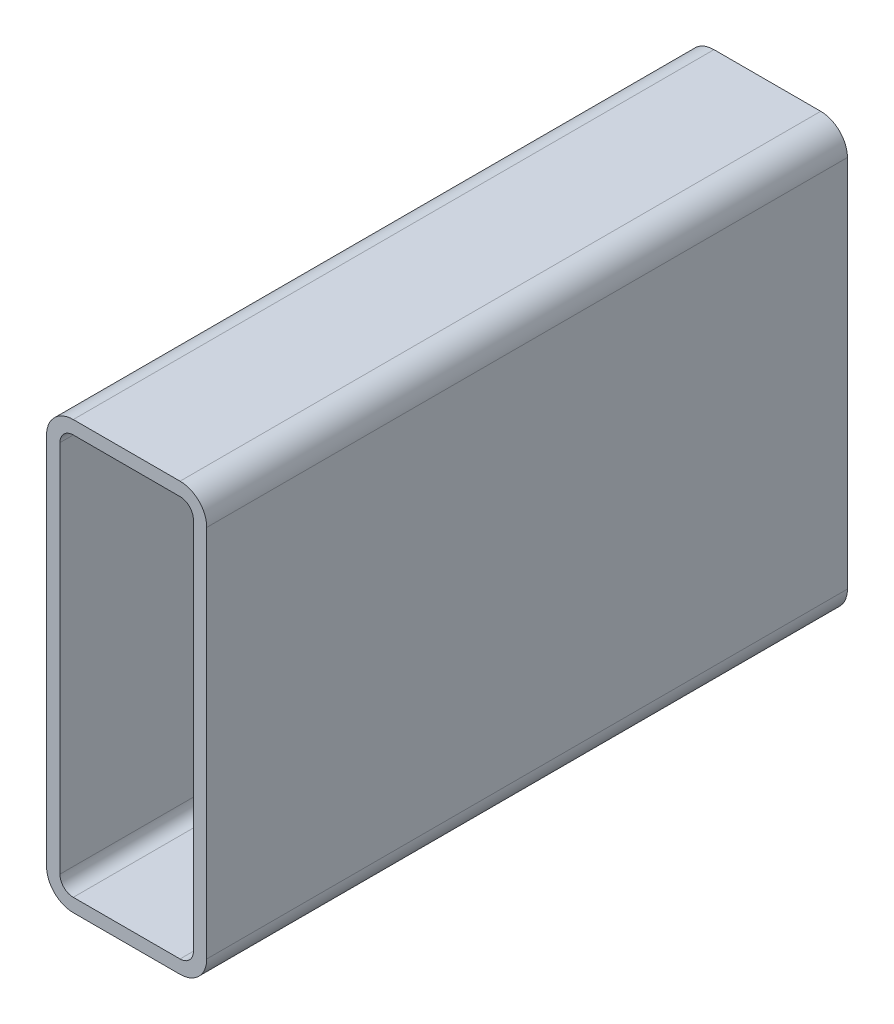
ISO-10303-21;
HEADER;
FILE_DESCRIPTION(('STEP AP214'),'2;1');
FILE_NAME('part.step','',(''),(''),'','','');
FILE_SCHEMA(('AUTOMOTIVE_DESIGN { 1 0 10303 214 1 1 1 1 }'));
ENDSEC;
DATA;
#1=APPLICATION_CONTEXT('core data for automotive mechanical design processes');
#2=APPLICATION_PROTOCOL_DEFINITION('international standard','automotive_design',2000,#1);
#3=PRODUCT_CONTEXT('',#1,'mechanical');
#4=PRODUCT('Part','Part','',(#3));
#5=PRODUCT_RELATED_PRODUCT_CATEGORY('part','',(#4));
#6=PRODUCT_DEFINITION_FORMATION('','',#4);
#7=PRODUCT_DEFINITION_CONTEXT('part definition',#1,'design');
#8=PRODUCT_DEFINITION('design','',#6,#7);
#9=PRODUCT_DEFINITION_SHAPE('','',#8);
#10=(LENGTH_UNIT() NAMED_UNIT(*) SI_UNIT(.MILLI.,.METRE.));
#11=(NAMED_UNIT(*) PLANE_ANGLE_UNIT() SI_UNIT($,.RADIAN.));
#12=(NAMED_UNIT(*) SI_UNIT($,.STERADIAN.) SOLID_ANGLE_UNIT());
#13=UNCERTAINTY_MEASURE_WITH_UNIT(LENGTH_MEASURE(1.E-05),#10,'distance_accuracy_value','');
#14=(GEOMETRIC_REPRESENTATION_CONTEXT(3) GLOBAL_UNCERTAINTY_ASSIGNED_CONTEXT((#13)) GLOBAL_UNIT_ASSIGNED_CONTEXT((#10,
#11,#12)) REPRESENTATION_CONTEXT('',''));
#15=CARTESIAN_POINT('',(0.,0.,0.));
#16=DIRECTION('',(0.,0.,1.));
#17=DIRECTION('',(1.,0.,0.));
#18=AXIS2_PLACEMENT_3D('',#15,#16,#17);
#19=CARTESIAN_POINT('',(15.1891160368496,192.466130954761,304.8));
#20=DIRECTION('',(0.,0.,1.));
#21=DIRECTION('',(1.,0.,0.));
#22=AXIS2_PLACEMENT_3D('',#19,#20,#21);
#23=PLANE('',#22);
#24=CARTESIAN_POINT('',(15.1891160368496,192.466130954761,304.8));
#25=DIRECTION('',(0.,0.,1.));
#26=DIRECTION('',(1.,0.,0.));
#27=AXIS2_PLACEMENT_3D('',#24,#25,#26);
#28=CIRCLE('',#27,12.7);
#29=CARTESIAN_POINT('',(15.1891160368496,205.166130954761,304.8));
#30=VERTEX_POINT('',#29);
#31=CARTESIAN_POINT('',(2.48911603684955,192.466130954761,304.8));
#32=VERTEX_POINT('',#31);
#33=EDGE_CURVE('E211',#30,#32,#28,.T.);
#34=ORIENTED_EDGE('',*,*,#33,.T.);
#35=DIRECTION('',(0.,-1.,0.));
#36=VECTOR('',#35,1.);
#37=CARTESIAN_POINT('',(2.48911603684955,14.6661309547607,304.8));
#38=LINE('',#37,#36);
#39=CARTESIAN_POINT('',(2.48911603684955,14.6661309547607,304.8));
#40=VERTEX_POINT('',#39);
#41=EDGE_CURVE('E214',#32,#40,#38,.T.);
#42=ORIENTED_EDGE('',*,*,#41,.T.);
#43=CARTESIAN_POINT('',(15.1891160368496,14.6661309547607,304.8));
#44=DIRECTION('',(0.,0.,1.));
#45=DIRECTION('',(1.,0.,0.));
#46=AXIS2_PLACEMENT_3D('',#43,#44,#45);
#47=CIRCLE('',#46,12.7);
#48=CARTESIAN_POINT('',(15.1891160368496,1.96613095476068,304.8));
#49=VERTEX_POINT('',#48);
#50=EDGE_CURVE('E217',#40,#49,#47,.T.);
#51=ORIENTED_EDGE('',*,*,#50,.T.);
#52=DIRECTION('',(1.,0.,0.));
#53=VECTOR('',#52,1.);
#54=CARTESIAN_POINT('',(65.9891160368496,1.96613095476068,304.8));
#55=LINE('',#54,#53);
#56=CARTESIAN_POINT('',(65.9891160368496,1.96613095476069,304.8));
#57=VERTEX_POINT('',#56);
#58=EDGE_CURVE('E219',#49,#57,#55,.T.);
#59=ORIENTED_EDGE('',*,*,#58,.T.);
#60=CARTESIAN_POINT('',(65.9891160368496,14.6661309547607,304.8));
#61=DIRECTION('',(0.,0.,1.));
#62=DIRECTION('',(1.,0.,0.));
#63=AXIS2_PLACEMENT_3D('',#60,#61,#62);
#64=CIRCLE('',#63,12.7);
#65=CARTESIAN_POINT('',(78.6891160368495,14.6661309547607,304.8));
#66=VERTEX_POINT('',#65);
#67=EDGE_CURVE('E221',#57,#66,#64,.T.);
#68=ORIENTED_EDGE('',*,*,#67,.T.);
#69=DIRECTION('',(0.,1.,0.));
#70=VECTOR('',#69,1.);
#71=CARTESIAN_POINT('',(78.6891160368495,192.466130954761,304.8));
#72=LINE('',#71,#70);
#73=CARTESIAN_POINT('',(78.6891160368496,192.466130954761,304.8));
#74=VERTEX_POINT('',#73);
#75=EDGE_CURVE('E223',#66,#74,#72,.T.);
#76=ORIENTED_EDGE('',*,*,#75,.T.);
#77=CARTESIAN_POINT('',(65.9891160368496,192.466130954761,304.8));
#78=DIRECTION('',(0.,0.,1.));
#79=DIRECTION('',(1.,0.,0.));
#80=AXIS2_PLACEMENT_3D('',#77,#78,#79);
#81=CIRCLE('',#80,12.7);
#82=CARTESIAN_POINT('',(65.9891160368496,205.166130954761,304.8));
#83=VERTEX_POINT('',#82);
#84=EDGE_CURVE('E225',#74,#83,#81,.T.);
#85=ORIENTED_EDGE('',*,*,#84,.T.);
#86=DIRECTION('',(-1.,0.,0.));
#87=VECTOR('',#86,1.);
#88=CARTESIAN_POINT('',(15.1891160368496,205.166130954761,304.8));
#89=LINE('',#88,#87);
#90=EDGE_CURVE('E227',#83,#30,#89,.T.);
#91=ORIENTED_EDGE('',*,*,#90,.T.);
#92=EDGE_LOOP('',(#34,#42,#51,#59,#68,#76,#85,#91));
#93=FACE_BOUND('',#92,.T.);
#94=DIRECTION('',(0.,-1.,0.));
#95=VECTOR('',#94,1.);
#96=CARTESIAN_POINT('',(8.83911603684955,14.6661309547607,304.8));
#97=LINE('',#96,#95);
#98=CARTESIAN_POINT('',(8.83911603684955,192.466130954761,304.8));
#99=VERTEX_POINT('',#98);
#100=CARTESIAN_POINT('',(8.83911603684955,14.6661309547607,304.8));
#101=VERTEX_POINT('',#100);
#102=EDGE_CURVE('E154',#99,#101,#97,.T.);
#103=ORIENTED_EDGE('',*,*,#102,.F.);
#104=CARTESIAN_POINT('',(15.1891160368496,192.466130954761,304.8));
#105=DIRECTION('',(0.,0.,1.));
#106=DIRECTION('',(1.,0.,0.));
#107=AXIS2_PLACEMENT_3D('',#104,#105,#106);
#108=CIRCLE('',#107,6.35000000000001);
#109=CARTESIAN_POINT('',(15.1891160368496,198.816130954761,304.8));
#110=VERTEX_POINT('',#109);
#111=EDGE_CURVE('E146',#110,#99,#108,.T.);
#112=ORIENTED_EDGE('',*,*,#111,.F.);
#113=DIRECTION('',(-1.,0.,0.));
#114=VECTOR('',#113,1.);
#115=CARTESIAN_POINT('',(15.1891160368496,198.816130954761,304.8));
#116=LINE('',#115,#114);
#117=CARTESIAN_POINT('',(65.9891160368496,198.816130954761,304.8));
#118=VERTEX_POINT('',#117);
#119=EDGE_CURVE('E179',#118,#110,#116,.T.);
#120=ORIENTED_EDGE('',*,*,#119,.F.);
#121=CARTESIAN_POINT('',(65.9891160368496,192.466130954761,304.8));
#122=DIRECTION('',(0.,0.,1.));
#123=DIRECTION('',(1.,0.,0.));
#124=AXIS2_PLACEMENT_3D('',#121,#122,#123);
#125=CIRCLE('',#124,6.35000000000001);
#126=CARTESIAN_POINT('',(72.3391160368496,192.466130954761,304.8));
#127=VERTEX_POINT('',#126);
#128=EDGE_CURVE('E177',#127,#118,#125,.T.);
#129=ORIENTED_EDGE('',*,*,#128,.F.);
#130=DIRECTION('',(0.,1.,0.));
#131=VECTOR('',#130,1.);
#132=CARTESIAN_POINT('',(72.3391160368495,192.466130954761,304.8));
#133=LINE('',#132,#131);
#134=CARTESIAN_POINT('',(72.3391160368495,14.6661309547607,304.8));
#135=VERTEX_POINT('',#134);
#136=EDGE_CURVE('E175',#135,#127,#133,.T.);
#137=ORIENTED_EDGE('',*,*,#136,.F.);
#138=CARTESIAN_POINT('',(65.9891160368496,14.6661309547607,304.8));
#139=DIRECTION('',(0.,0.,1.));
#140=DIRECTION('',(1.,0.,0.));
#141=AXIS2_PLACEMENT_3D('',#138,#139,#140);
#142=CIRCLE('',#141,6.35);
#143=CARTESIAN_POINT('',(65.9891160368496,8.31613095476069,304.8));
#144=VERTEX_POINT('',#143);
#145=EDGE_CURVE('E173',#144,#135,#142,.T.);
#146=ORIENTED_EDGE('',*,*,#145,.F.);
#147=DIRECTION('',(1.,0.,0.));
#148=VECTOR('',#147,1.);
#149=CARTESIAN_POINT('',(65.9891160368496,8.31613095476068,304.8));
#150=LINE('',#149,#148);
#151=CARTESIAN_POINT('',(15.1891160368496,8.31613095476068,304.8));
#152=VERTEX_POINT('',#151);
#153=EDGE_CURVE('E169',#152,#144,#150,.T.);
#154=ORIENTED_EDGE('',*,*,#153,.F.);
#155=CARTESIAN_POINT('',(15.1891160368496,14.6661309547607,304.8));
#156=DIRECTION('',(0.,0.,1.));
#157=DIRECTION('',(1.,0.,0.));
#158=AXIS2_PLACEMENT_3D('',#155,#156,#157);
#159=CIRCLE('',#158,6.35);
#160=EDGE_CURVE('E167',#101,#152,#159,.T.);
#161=ORIENTED_EDGE('',*,*,#160,.F.);
#162=EDGE_LOOP('',(#103,#112,#120,#129,#137,#146,#154,#161));
#163=FACE_BOUND('',#162,.T.);
#164=ADVANCED_FACE('F33',(#93,#163),#23,.T.);
#165=CARTESIAN_POINT('',(15.1891160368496,192.466130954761,0.));
#166=DIRECTION('',(0.,0.,1.));
#167=DIRECTION('',(1.,0.,0.));
#168=AXIS2_PLACEMENT_3D('',#165,#166,#167);
#169=PLANE('',#168);
#170=CARTESIAN_POINT('',(15.1891160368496,192.466130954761,0.));
#171=DIRECTION('',(0.,0.,1.));
#172=DIRECTION('',(1.,0.,0.));
#173=AXIS2_PLACEMENT_3D('',#170,#171,#172);
#174=CIRCLE('',#173,12.7);
#175=CARTESIAN_POINT('',(15.1891160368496,205.166130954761,0.));
#176=VERTEX_POINT('',#175);
#177=CARTESIAN_POINT('',(2.48911603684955,192.466130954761,0.));
#178=VERTEX_POINT('',#177);
#179=EDGE_CURVE('E162',#176,#178,#174,.T.);
#180=ORIENTED_EDGE('',*,*,#179,.F.);
#181=DIRECTION('',(-1.,0.,0.));
#182=VECTOR('',#181,1.);
#183=CARTESIAN_POINT('',(15.1891160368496,205.166130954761,0.));
#184=LINE('',#183,#182);
#185=CARTESIAN_POINT('',(65.9891160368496,205.166130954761,0.));
#186=VERTEX_POINT('',#185);
#187=EDGE_CURVE('E215',#186,#176,#184,.T.);
#188=ORIENTED_EDGE('',*,*,#187,.F.);
#189=CARTESIAN_POINT('',(65.9891160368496,192.466130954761,0.));
#190=DIRECTION('',(0.,0.,1.));
#191=DIRECTION('',(1.,0.,0.));
#192=AXIS2_PLACEMENT_3D('',#189,#190,#191);
#193=CIRCLE('',#192,12.7);
#194=CARTESIAN_POINT('',(78.6891160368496,192.466130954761,0.));
#195=VERTEX_POINT('',#194);
#196=EDGE_CURVE('E242',#195,#186,#193,.T.);
#197=ORIENTED_EDGE('',*,*,#196,.F.);
#198=DIRECTION('',(0.,1.,0.));
#199=VECTOR('',#198,1.);
#200=CARTESIAN_POINT('',(78.6891160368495,192.466130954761,0.));
#201=LINE('',#200,#199);
#202=CARTESIAN_POINT('',(78.6891160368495,14.6661309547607,0.));
#203=VERTEX_POINT('',#202);
#204=EDGE_CURVE('E240',#203,#195,#201,.T.);
#205=ORIENTED_EDGE('',*,*,#204,.F.);
#206=CARTESIAN_POINT('',(65.9891160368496,14.6661309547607,0.));
#207=DIRECTION('',(0.,0.,1.));
#208=DIRECTION('',(1.,0.,0.));
#209=AXIS2_PLACEMENT_3D('',#206,#207,#208);
#210=CIRCLE('',#209,12.7);
#211=CARTESIAN_POINT('',(65.9891160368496,1.96613095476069,0.));
#212=VERTEX_POINT('',#211);
#213=EDGE_CURVE('E238',#212,#203,#210,.T.);
#214=ORIENTED_EDGE('',*,*,#213,.F.);
#215=DIRECTION('',(1.,0.,0.));
#216=VECTOR('',#215,1.);
#217=CARTESIAN_POINT('',(65.9891160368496,1.96613095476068,0.));
#218=LINE('',#217,#216);
#219=CARTESIAN_POINT('',(15.1891160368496,1.96613095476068,0.));
#220=VERTEX_POINT('',#219);
#221=EDGE_CURVE('E236',#220,#212,#218,.T.);
#222=ORIENTED_EDGE('',*,*,#221,.F.);
#223=CARTESIAN_POINT('',(15.1891160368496,14.6661309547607,0.));
#224=DIRECTION('',(0.,0.,1.));
#225=DIRECTION('',(1.,0.,0.));
#226=AXIS2_PLACEMENT_3D('',#223,#224,#225);
#227=CIRCLE('',#226,12.7);
#228=CARTESIAN_POINT('',(2.48911603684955,14.6661309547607,0.));
#229=VERTEX_POINT('',#228);
#230=EDGE_CURVE('E234',#229,#220,#227,.T.);
#231=ORIENTED_EDGE('',*,*,#230,.F.);
#232=DIRECTION('',(0.,-1.,0.));
#233=VECTOR('',#232,1.);
#234=CARTESIAN_POINT('',(2.48911603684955,14.6661309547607,0.));
#235=LINE('',#234,#233);
#236=EDGE_CURVE('E232',#178,#229,#235,.T.);
#237=ORIENTED_EDGE('',*,*,#236,.F.);
#238=EDGE_LOOP('',(#180,#188,#197,#205,#214,#222,#231,#237));
#239=FACE_BOUND('',#238,.T.);
#240=CARTESIAN_POINT('',(15.1891160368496,192.466130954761,0.));
#241=DIRECTION('',(0.,0.,1.));
#242=DIRECTION('',(1.,0.,0.));
#243=AXIS2_PLACEMENT_3D('',#240,#241,#242);
#244=CIRCLE('',#243,6.35000000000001);
#245=CARTESIAN_POINT('',(15.1891160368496,198.816130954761,0.));
#246=VERTEX_POINT('',#245);
#247=CARTESIAN_POINT('',(8.83911603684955,192.466130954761,0.));
#248=VERTEX_POINT('',#247);
#249=EDGE_CURVE('E56',#246,#248,#244,.T.);
#250=ORIENTED_EDGE('',*,*,#249,.T.);
#251=DIRECTION('',(0.,-1.,0.));
#252=VECTOR('',#251,1.);
#253=CARTESIAN_POINT('',(8.83911603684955,14.6661309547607,0.));
#254=LINE('',#253,#252);
#255=CARTESIAN_POINT('',(8.83911603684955,14.6661309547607,0.));
#256=VERTEX_POINT('',#255);
#257=EDGE_CURVE('E161',#248,#256,#254,.T.);
#258=ORIENTED_EDGE('',*,*,#257,.T.);
#259=CARTESIAN_POINT('',(15.1891160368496,14.6661309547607,0.));
#260=DIRECTION('',(0.,0.,1.));
#261=DIRECTION('',(1.,0.,0.));
#262=AXIS2_PLACEMENT_3D('',#259,#260,#261);
#263=CIRCLE('',#262,6.35);
#264=CARTESIAN_POINT('',(15.1891160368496,8.31613095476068,0.));
#265=VERTEX_POINT('',#264);
#266=EDGE_CURVE('E183',#256,#265,#263,.T.);
#267=ORIENTED_EDGE('',*,*,#266,.T.);
#268=DIRECTION('',(1.,0.,0.));
#269=VECTOR('',#268,1.);
#270=CARTESIAN_POINT('',(65.9891160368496,8.31613095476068,0.));
#271=LINE('',#270,#269);
#272=CARTESIAN_POINT('',(65.9891160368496,8.31613095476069,0.));
#273=VERTEX_POINT('',#272);
#274=EDGE_CURVE('E186',#265,#273,#271,.T.);
#275=ORIENTED_EDGE('',*,*,#274,.T.);
#276=CARTESIAN_POINT('',(65.9891160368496,14.6661309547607,0.));
#277=DIRECTION('',(0.,0.,1.));
#278=DIRECTION('',(1.,0.,0.));
#279=AXIS2_PLACEMENT_3D('',#276,#277,#278);
#280=CIRCLE('',#279,6.35);
#281=CARTESIAN_POINT('',(72.3391160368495,14.6661309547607,0.));
#282=VERTEX_POINT('',#281);
#283=EDGE_CURVE('E189',#273,#282,#280,.T.);
#284=ORIENTED_EDGE('',*,*,#283,.T.);
#285=DIRECTION('',(0.,1.,0.));
#286=VECTOR('',#285,1.);
#287=CARTESIAN_POINT('',(72.3391160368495,192.466130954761,0.));
#288=LINE('',#287,#286);
#289=CARTESIAN_POINT('',(72.3391160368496,192.466130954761,0.));
#290=VERTEX_POINT('',#289);
#291=EDGE_CURVE('E192',#282,#290,#288,.T.);
#292=ORIENTED_EDGE('',*,*,#291,.T.);
#293=CARTESIAN_POINT('',(65.9891160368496,192.466130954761,0.));
#294=DIRECTION('',(0.,0.,1.));
#295=DIRECTION('',(1.,0.,0.));
#296=AXIS2_PLACEMENT_3D('',#293,#294,#295);
#297=CIRCLE('',#296,6.35000000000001);
#298=CARTESIAN_POINT('',(65.9891160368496,198.816130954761,0.));
#299=VERTEX_POINT('',#298);
#300=EDGE_CURVE('E195',#290,#299,#297,.T.);
#301=ORIENTED_EDGE('',*,*,#300,.T.);
#302=DIRECTION('',(-1.,0.,0.));
#303=VECTOR('',#302,1.);
#304=CARTESIAN_POINT('',(15.1891160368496,198.816130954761,0.));
#305=LINE('',#304,#303);
#306=EDGE_CURVE('E155',#299,#246,#305,.T.);
#307=ORIENTED_EDGE('',*,*,#306,.T.);
#308=EDGE_LOOP('',(#250,#258,#267,#275,#284,#292,#301,#307));
#309=FACE_BOUND('',#308,.T.);
#310=ADVANCED_FACE('F272',(#239,#309),#169,.F.);
#311=CARTESIAN_POINT('',(15.1891160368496,192.466130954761,304.8));
#312=DIRECTION('',(0.,0.,-1.));
#313=DIRECTION('',(-1.,0.,0.));
#314=AXIS2_PLACEMENT_3D('',#311,#312,#313);
#315=CYLINDRICAL_SURFACE('',#314,12.7);
#316=ORIENTED_EDGE('',*,*,#179,.T.);
#317=DIRECTION('',(0.,0.,-1.));
#318=VECTOR('',#317,1.);
#319=CARTESIAN_POINT('',(2.48911603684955,192.466130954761,304.8));
#320=LINE('',#319,#318);
#321=EDGE_CURVE('E11',#32,#178,#320,.T.);
#322=ORIENTED_EDGE('',*,*,#321,.F.);
#323=ORIENTED_EDGE('',*,*,#33,.F.);
#324=DIRECTION('',(0.,0.,-1.));
#325=VECTOR('',#324,1.);
#326=CARTESIAN_POINT('',(15.1891160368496,205.166130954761,304.8));
#327=LINE('',#326,#325);
#328=EDGE_CURVE('E229',#30,#176,#327,.T.);
#329=ORIENTED_EDGE('',*,*,#328,.T.);
#330=EDGE_LOOP('',(#316,#322,#323,#329));
#331=FACE_BOUND('',#330,.T.);
#332=ADVANCED_FACE('F35',(#331),#315,.T.);
#333=CARTESIAN_POINT('',(2.48911603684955,14.6661309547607,304.8));
#334=DIRECTION('',(1.,0.,0.));
#335=DIRECTION('',(0.,0.,-1.));
#336=AXIS2_PLACEMENT_3D('',#333,#334,#335);
#337=PLANE('',#336);
#338=ORIENTED_EDGE('',*,*,#236,.T.);
#339=DIRECTION('',(0.,0.,-1.));
#340=VECTOR('',#339,1.);
#341=CARTESIAN_POINT('',(2.48911603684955,14.6661309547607,304.8));
#342=LINE('',#341,#340);
#343=EDGE_CURVE('E41',#40,#229,#342,.T.);
#344=ORIENTED_EDGE('',*,*,#343,.F.);
#345=ORIENTED_EDGE('',*,*,#41,.F.);
#346=ORIENTED_EDGE('',*,*,#321,.T.);
#347=EDGE_LOOP('',(#338,#344,#345,#346));
#348=FACE_BOUND('',#347,.T.);
#349=ADVANCED_FACE('F289',(#348),#337,.F.);
#350=CARTESIAN_POINT('',(15.1891160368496,14.6661309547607,304.8));
#351=DIRECTION('',(0.,0.,-1.));
#352=DIRECTION('',(-1.,0.,0.));
#353=AXIS2_PLACEMENT_3D('',#350,#351,#352);
#354=CYLINDRICAL_SURFACE('',#353,12.7);
#355=ORIENTED_EDGE('',*,*,#230,.T.);
#356=DIRECTION('',(0.,0.,-1.));
#357=VECTOR('',#356,1.);
#358=CARTESIAN_POINT('',(15.1891160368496,1.96613095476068,304.8));
#359=LINE('',#358,#357);
#360=EDGE_CURVE('E259',#49,#220,#359,.T.);
#361=ORIENTED_EDGE('',*,*,#360,.F.);
#362=ORIENTED_EDGE('',*,*,#50,.F.);
#363=ORIENTED_EDGE('',*,*,#343,.T.);
#364=EDGE_LOOP('',(#355,#361,#362,#363));
#365=FACE_BOUND('',#364,.T.);
#366=ADVANCED_FACE('F266',(#365),#354,.T.);
#367=CARTESIAN_POINT('',(65.9891160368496,1.96613095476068,304.8));
#368=DIRECTION('',(0.,1.,0.));
#369=DIRECTION('',(0.,0.,1.));
#370=AXIS2_PLACEMENT_3D('',#367,#368,#369);
#371=PLANE('',#370);
#372=ORIENTED_EDGE('',*,*,#221,.T.);
#373=DIRECTION('',(0.,0.,-1.));
#374=VECTOR('',#373,1.);
#375=CARTESIAN_POINT('',(65.9891160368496,1.96613095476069,304.8));
#376=LINE('',#375,#374);
#377=EDGE_CURVE('E256',#57,#212,#376,.T.);
#378=ORIENTED_EDGE('',*,*,#377,.F.);
#379=ORIENTED_EDGE('',*,*,#58,.F.);
#380=ORIENTED_EDGE('',*,*,#360,.T.);
#381=EDGE_LOOP('',(#372,#378,#379,#380));
#382=FACE_BOUND('',#381,.T.);
#383=ADVANCED_FACE('F278',(#382),#371,.F.);
#384=CARTESIAN_POINT('',(65.9891160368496,14.6661309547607,304.8));
#385=DIRECTION('',(0.,0.,-1.));
#386=DIRECTION('',(-1.,0.,0.));
#387=AXIS2_PLACEMENT_3D('',#384,#385,#386);
#388=CYLINDRICAL_SURFACE('',#387,12.7);
#389=ORIENTED_EDGE('',*,*,#213,.T.);
#390=DIRECTION('',(0.,0.,-1.));
#391=VECTOR('',#390,1.);
#392=CARTESIAN_POINT('',(78.6891160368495,14.6661309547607,304.8));
#393=LINE('',#392,#391);
#394=EDGE_CURVE('E253',#66,#203,#393,.T.);
#395=ORIENTED_EDGE('',*,*,#394,.F.);
#396=ORIENTED_EDGE('',*,*,#67,.F.);
#397=ORIENTED_EDGE('',*,*,#377,.T.);
#398=EDGE_LOOP('',(#389,#395,#396,#397));
#399=FACE_BOUND('',#398,.T.);
#400=ADVANCED_FACE('F282',(#399),#388,.T.);
#401=CARTESIAN_POINT('',(78.6891160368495,192.466130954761,304.8));
#402=DIRECTION('',(-1.,0.,0.));
#403=DIRECTION('',(0.,0.,1.));
#404=AXIS2_PLACEMENT_3D('',#401,#402,#403);
#405=PLANE('',#404);
#406=ORIENTED_EDGE('',*,*,#204,.T.);
#407=DIRECTION('',(0.,0.,-1.));
#408=VECTOR('',#407,1.);
#409=CARTESIAN_POINT('',(78.6891160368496,192.466130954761,304.8));
#410=LINE('',#409,#408);
#411=EDGE_CURVE('E250',#74,#195,#410,.T.);
#412=ORIENTED_EDGE('',*,*,#411,.F.);
#413=ORIENTED_EDGE('',*,*,#75,.F.);
#414=ORIENTED_EDGE('',*,*,#394,.T.);
#415=EDGE_LOOP('',(#406,#412,#413,#414));
#416=FACE_BOUND('',#415,.T.);
#417=ADVANCED_FACE('F302',(#416),#405,.F.);
#418=CARTESIAN_POINT('',(65.9891160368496,192.466130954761,304.8));
#419=DIRECTION('',(0.,0.,-1.));
#420=DIRECTION('',(-1.,0.,0.));
#421=AXIS2_PLACEMENT_3D('',#418,#419,#420);
#422=CYLINDRICAL_SURFACE('',#421,12.7);
#423=ORIENTED_EDGE('',*,*,#196,.T.);
#424=DIRECTION('',(0.,0.,-1.));
#425=VECTOR('',#424,1.);
#426=CARTESIAN_POINT('',(65.9891160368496,205.166130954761,304.8));
#427=LINE('',#426,#425);
#428=EDGE_CURVE('E247',#83,#186,#427,.T.);
#429=ORIENTED_EDGE('',*,*,#428,.F.);
#430=ORIENTED_EDGE('',*,*,#84,.F.);
#431=ORIENTED_EDGE('',*,*,#411,.T.);
#432=EDGE_LOOP('',(#423,#429,#430,#431));
#433=FACE_BOUND('',#432,.T.);
#434=ADVANCED_FACE('F300',(#433),#422,.T.);
#435=CARTESIAN_POINT('',(15.1891160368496,205.166130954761,304.8));
#436=DIRECTION('',(0.,-1.,0.));
#437=DIRECTION('',(0.,0.,-1.));
#438=AXIS2_PLACEMENT_3D('',#435,#436,#437);
#439=PLANE('',#438);
#440=ORIENTED_EDGE('',*,*,#187,.T.);
#441=ORIENTED_EDGE('',*,*,#328,.F.);
#442=ORIENTED_EDGE('',*,*,#90,.F.);
#443=ORIENTED_EDGE('',*,*,#428,.T.);
#444=EDGE_LOOP('',(#440,#441,#442,#443));
#445=FACE_BOUND('',#444,.T.);
#446=ADVANCED_FACE('F295',(#445),#439,.F.);
#447=CARTESIAN_POINT('',(15.1891160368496,192.466130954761,304.8));
#448=DIRECTION('',(0.,0.,-1.));
#449=DIRECTION('',(-1.,0.,0.));
#450=AXIS2_PLACEMENT_3D('',#447,#448,#449);
#451=CYLINDRICAL_SURFACE('',#450,6.35000000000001);
#452=ORIENTED_EDGE('',*,*,#249,.F.);
#453=DIRECTION('',(0.,0.,-1.));
#454=VECTOR('',#453,1.);
#455=CARTESIAN_POINT('',(15.1891160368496,198.816130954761,304.8));
#456=LINE('',#455,#454);
#457=EDGE_CURVE('E150',#110,#246,#456,.T.);
#458=ORIENTED_EDGE('',*,*,#457,.F.);
#459=ORIENTED_EDGE('',*,*,#111,.T.);
#460=DIRECTION('',(0.,0.,-1.));
#461=VECTOR('',#460,1.);
#462=CARTESIAN_POINT('',(8.83911603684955,192.466130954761,304.8));
#463=LINE('',#462,#461);
#464=EDGE_CURVE('E149',#99,#248,#463,.T.);
#465=ORIENTED_EDGE('',*,*,#464,.T.);
#466=EDGE_LOOP('',(#452,#458,#459,#465));
#467=FACE_BOUND('',#466,.T.);
#468=ADVANCED_FACE('F148',(#467),#451,.F.);
#469=CARTESIAN_POINT('',(8.83911603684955,14.6661309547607,304.8));
#470=DIRECTION('',(1.,0.,0.));
#471=DIRECTION('',(0.,0.,-1.));
#472=AXIS2_PLACEMENT_3D('',#469,#470,#471);
#473=PLANE('',#472);
#474=ORIENTED_EDGE('',*,*,#257,.F.);
#475=ORIENTED_EDGE('',*,*,#464,.F.);
#476=ORIENTED_EDGE('',*,*,#102,.T.);
#477=DIRECTION('',(0.,0.,-1.));
#478=VECTOR('',#477,1.);
#479=CARTESIAN_POINT('',(8.83911603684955,14.6661309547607,304.8));
#480=LINE('',#479,#478);
#481=EDGE_CURVE('E163',#101,#256,#480,.T.);
#482=ORIENTED_EDGE('',*,*,#481,.T.);
#483=EDGE_LOOP('',(#474,#475,#476,#482));
#484=FACE_BOUND('',#483,.T.);
#485=ADVANCED_FACE('F158',(#484),#473,.T.);
#486=CARTESIAN_POINT('',(15.1891160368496,14.6661309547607,304.8));
#487=DIRECTION('',(0.,0.,-1.));
#488=DIRECTION('',(-1.,0.,0.));
#489=AXIS2_PLACEMENT_3D('',#486,#487,#488);
#490=CYLINDRICAL_SURFACE('',#489,6.35);
#491=ORIENTED_EDGE('',*,*,#266,.F.);
#492=ORIENTED_EDGE('',*,*,#481,.F.);
#493=ORIENTED_EDGE('',*,*,#160,.T.);
#494=DIRECTION('',(0.,0.,-1.));
#495=VECTOR('',#494,1.);
#496=CARTESIAN_POINT('',(15.1891160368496,8.31613095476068,304.8));
#497=LINE('',#496,#495);
#498=EDGE_CURVE('E208',#152,#265,#497,.T.);
#499=ORIENTED_EDGE('',*,*,#498,.T.);
#500=EDGE_LOOP('',(#491,#492,#493,#499));
#501=FACE_BOUND('',#500,.T.);
#502=ADVANCED_FACE('F327',(#501),#490,.F.);
#503=CARTESIAN_POINT('',(65.9891160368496,8.31613095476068,304.8));
#504=DIRECTION('',(0.,1.,0.));
#505=DIRECTION('',(0.,0.,1.));
#506=AXIS2_PLACEMENT_3D('',#503,#504,#505);
#507=PLANE('',#506);
#508=ORIENTED_EDGE('',*,*,#274,.F.);
#509=ORIENTED_EDGE('',*,*,#498,.F.);
#510=ORIENTED_EDGE('',*,*,#153,.T.);
#511=DIRECTION('',(0.,0.,-1.));
#512=VECTOR('',#511,1.);
#513=CARTESIAN_POINT('',(65.9891160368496,8.31613095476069,304.8));
#514=LINE('',#513,#512);
#515=EDGE_CURVE('E206',#144,#273,#514,.T.);
#516=ORIENTED_EDGE('',*,*,#515,.T.);
#517=EDGE_LOOP('',(#508,#509,#510,#516));
#518=FACE_BOUND('',#517,.T.);
#519=ADVANCED_FACE('F331',(#518),#507,.T.);
#520=CARTESIAN_POINT('',(65.9891160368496,14.6661309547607,304.8));
#521=DIRECTION('',(0.,0.,-1.));
#522=DIRECTION('',(-1.,0.,0.));
#523=AXIS2_PLACEMENT_3D('',#520,#521,#522);
#524=CYLINDRICAL_SURFACE('',#523,6.35);
#525=ORIENTED_EDGE('',*,*,#283,.F.);
#526=ORIENTED_EDGE('',*,*,#515,.F.);
#527=ORIENTED_EDGE('',*,*,#145,.T.);
#528=DIRECTION('',(0.,0.,-1.));
#529=VECTOR('',#528,1.);
#530=CARTESIAN_POINT('',(72.3391160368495,14.6661309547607,304.8));
#531=LINE('',#530,#529);
#532=EDGE_CURVE('E204',#135,#282,#531,.T.);
#533=ORIENTED_EDGE('',*,*,#532,.T.);
#534=EDGE_LOOP('',(#525,#526,#527,#533));
#535=FACE_BOUND('',#534,.T.);
#536=ADVANCED_FACE('F337',(#535),#524,.F.);
#537=CARTESIAN_POINT('',(72.3391160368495,192.466130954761,304.8));
#538=DIRECTION('',(-1.,0.,0.));
#539=DIRECTION('',(0.,0.,1.));
#540=AXIS2_PLACEMENT_3D('',#537,#538,#539);
#541=PLANE('',#540);
#542=ORIENTED_EDGE('',*,*,#291,.F.);
#543=ORIENTED_EDGE('',*,*,#532,.F.);
#544=ORIENTED_EDGE('',*,*,#136,.T.);
#545=DIRECTION('',(0.,0.,-1.));
#546=VECTOR('',#545,1.);
#547=CARTESIAN_POINT('',(72.3391160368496,192.466130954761,304.8));
#548=LINE('',#547,#546);
#549=EDGE_CURVE('E202',#127,#290,#548,.T.);
#550=ORIENTED_EDGE('',*,*,#549,.T.);
#551=EDGE_LOOP('',(#542,#543,#544,#550));
#552=FACE_BOUND('',#551,.T.);
#553=ADVANCED_FACE('F341',(#552),#541,.T.);
#554=CARTESIAN_POINT('',(65.9891160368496,192.466130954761,304.8));
#555=DIRECTION('',(0.,0.,-1.));
#556=DIRECTION('',(-1.,0.,0.));
#557=AXIS2_PLACEMENT_3D('',#554,#555,#556);
#558=CYLINDRICAL_SURFACE('',#557,6.35000000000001);
#559=ORIENTED_EDGE('',*,*,#300,.F.);
#560=ORIENTED_EDGE('',*,*,#549,.F.);
#561=ORIENTED_EDGE('',*,*,#128,.T.);
#562=DIRECTION('',(0.,0.,-1.));
#563=VECTOR('',#562,1.);
#564=CARTESIAN_POINT('',(65.9891160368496,198.816130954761,304.8));
#565=LINE('',#564,#563);
#566=EDGE_CURVE('E48',#118,#299,#565,.T.);
#567=ORIENTED_EDGE('',*,*,#566,.T.);
#568=EDGE_LOOP('',(#559,#560,#561,#567));
#569=FACE_BOUND('',#568,.T.);
#570=ADVANCED_FACE('F345',(#569),#558,.F.);
#571=CARTESIAN_POINT('',(15.1891160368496,198.816130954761,304.8));
#572=DIRECTION('',(0.,-1.,0.));
#573=DIRECTION('',(0.,0.,-1.));
#574=AXIS2_PLACEMENT_3D('',#571,#572,#573);
#575=PLANE('',#574);
#576=ORIENTED_EDGE('',*,*,#306,.F.);
#577=ORIENTED_EDGE('',*,*,#566,.F.);
#578=ORIENTED_EDGE('',*,*,#119,.T.);
#579=ORIENTED_EDGE('',*,*,#457,.T.);
#580=EDGE_LOOP('',(#576,#577,#578,#579));
#581=FACE_BOUND('',#580,.T.);
#582=ADVANCED_FACE('F349',(#581),#575,.T.);
#583=CLOSED_SHELL('',(#164,#310,#332,#349,#366,#383,#400,#417,#434,#446,#468,#485,#502,#519,
#536,#553,#570,#582));
#584=MANIFOLD_SOLID_BREP('B2',#583);
#585=ADVANCED_BREP_SHAPE_REPRESENTATION('',(#18,#584),#14);
#586=SHAPE_DEFINITION_REPRESENTATION(#9,#585);
ENDSEC;
END-ISO-10303-21;
